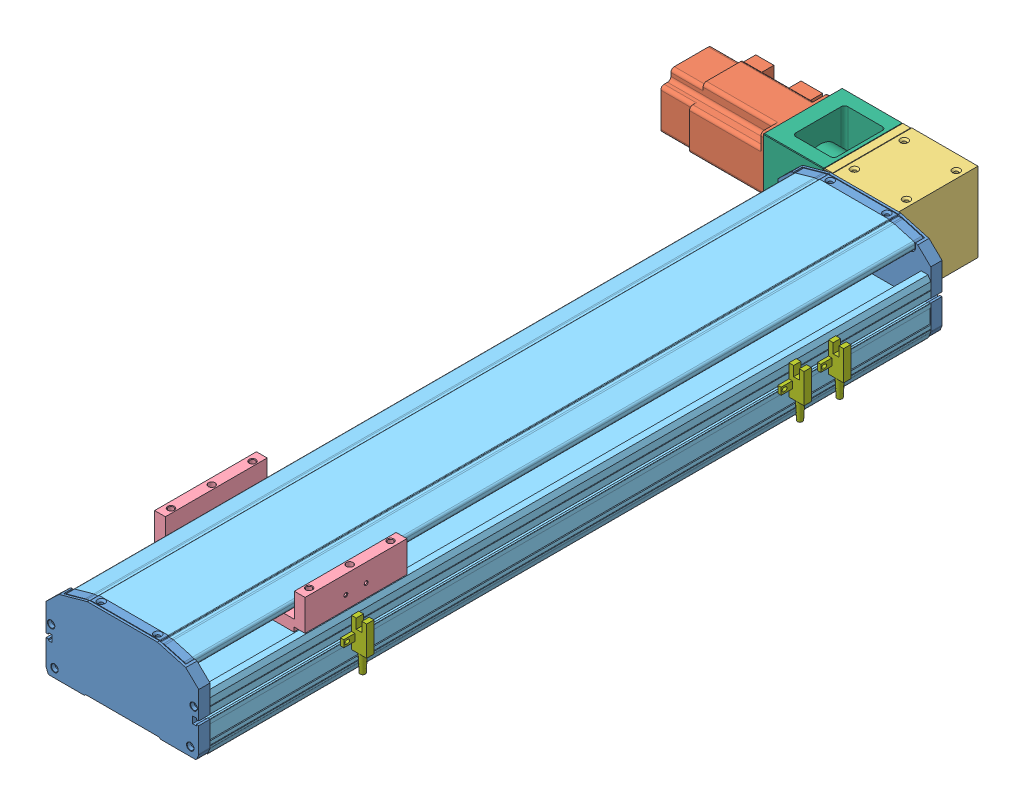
SolidWorks assembly TCD135-T-ZJ3B-0.SLDASM, configuration 400 (file format 9000). Lengths in mm.
Overall size (270.05 78 739).
10 component instances, 7 part files, 28 mates.
Components (placement in the parent):
- TCD135-T-ZJ3B-6-1: TCD135-T-ZJ3B-6.SLDPRT [默认] at origin
- TCD135-T-ZJ3B-3-1: TCD135-T-ZJ3B-3.SLDPRT [默认] at (-97.75 36.9 -35) x (0 0 1) z (-1 0 0)
- TCD135-T-ZJ3B-5-1: TCD135-T-ZJ3B-5.SLDPRT [默认] at (29.25 36.9 -35) x (0 1 0) z (-1 0 0)
- TCD135-T-ZJ3B-6-2: TCD135-T-ZJ3B-6.SLDPRT [默认] at (0 0 657) x (-1 0 0) z (0 0 -1)
- TCD135-T-ZJ3B-1-1: TCD135-T-ZJ3B-1.sldprt [默认] at (0 33.9 517)
- TCD135-T-ZJ3B-2-2: TCD135-T-ZJ3B-2.SLDPRT [400] at (0 0 10) x (-1 0 0) z (0 0 -1) size (135 73.5 637)
- TCD135-T-ZJ3B-4-1: TCD135-T-ZJ3B-4.SLDPRT [默认] at (-90.75 36.9 -35) x (0 0 -1) z (0 1 0)
- TCD135-T-ZJ3B-7-1: TCD135-T-ZJ3B-7.sldprt [默认] at (11 -5.2004 -46.2996)
- TCD135-T-ZJ3B-7-2: TCD135-T-ZJ3B-7.sldprt [默认] at (11 -5.2004 375.3004)
- TCD135-T-ZJ3B-7-3: TCD135-T-ZJ3B-7.sldprt [默认] at (11 -5.2004 -11.2996)
Mates (geometry in assembly coordinates):
- 重合6: coincident anti-aligned: plane of TCD135-T-ZJ3B-6-1 through (64.1333 0.9 0) normal (0 0 -1); plane of TCD135-T-ZJ3B-5-1 through (-29.25 1.9 0) normal (0 0 1)
- LimitDistance1: limit distance = 542 mm aligned: plane of TCD135-T-ZJ3B-5-1 through (-29.25 1.9 -70) normal (0 0 -1); plane of TCD135-T-ZJ3B-1-1 through (0 60.65 472) normal (0 0 -1)
- LimitDistance2: limit distance = 95 mm aligned: plane of TCD135-T-ZJ3B-1-1 through (0 60.65 562) normal (0 0 1); plane of TCD135-T-ZJ3B-6-2 through (-64.1333 0.9 657) normal (0 0 1)
- 重合18: coincident anti-aligned: plane of TCD135-T-ZJ3B-6-1 through (64.1333 0.9 10) normal (0 0 1); plane of TCD135-T-ZJ3B-2-2 through (67.5 6 10) normal (0 0 -1)
- 重合19: coincident aligned: plane of TCD135-T-ZJ3B-6-1 through (30.5 71.9 -105.7277) normal (0 1 0); plane of TCD135-T-ZJ3B-2-2 through (-30.5 71.9 647) normal (0 1 0)
- 重合20: coincident aligned: plane of TCD135-T-ZJ3B-6-1 through (-67.5 29.8 10) normal (-1 0 0); plane of TCD135-T-ZJ3B-2-2 through (-67.5 22.5 647) normal (-1 0 0)
- 距离7: distance = 0.5 mm aligned: plane of TCD135-T-ZJ3B-1-1 through (-66.5 62.65 517) normal (-1 0 0); plane of TCD135-T-ZJ3B-2-2 through (-67 10 647) normal (-1 0 0)
- 重合21: coincident aligned: plane of TCD135-T-ZJ3B-6-2 through (-67.5 29.8 647) normal (-1 0 0); plane of TCD135-T-ZJ3B-2-2 through (-67.5 30.1 647) normal (-1 0 0)
- 重合22: coincident aligned: plane of TCD135-T-ZJ3B-6-2 through (-30.5 71.9 762.7277) normal (0 1 0); plane of TCD135-T-ZJ3B-2-2 through (-30.5 71.9 647) normal (0 1 0)
- 重合23: coincident anti-aligned: plane of TCD135-T-ZJ3B-6-2 through (-64.1333 0.9 647) normal (0 0 -1); plane of TCD135-T-ZJ3B-2-2 through (67.5 6 647) normal (0 0 1)
- 距离8: distance = 78 mm anti-aligned: plane of TCD135-T-ZJ3B-1-1 through (-61.75 76.4 517) normal (0 1 0); plane of TCD135-T-ZJ3B-2-2 through (-34.1 -1.6 647) normal (0 -1 0)
- 重合24: coincident aligned: plane of TCD135-T-ZJ3B-5-1 through (-29.25 71.9 0) normal (0 1 0); plane of TCD135-T-ZJ3B-2-2 through (-30.5 71.9 647) normal (0 1 0)
- 距离9: distance = 30.25 mm aligned: plane of TCD135-T-ZJ3B-5-1 through (-37.25 36.9 -35) normal (-1 0 0); plane of TCD135-T-ZJ3B-6-1 through (-67.5 29.8 10) normal (-1 0 0)
- 重合28: coincident anti-aligned: plane of TCD135-T-ZJ3B-3-1 through (-90.75 9.9 -8) normal (1 0 0); plane of TCD135-T-ZJ3B-4-1 through (-90.75 36.9 -35) normal (-1 0 0)
- 距离10: distance = 5 mm aligned: plane of TCD135-T-ZJ3B-3-1 through (-189.15 6.9 -50) normal (0 -1 0); plane of TCD135-T-ZJ3B-4-1 through (-37.25 1.9 0) normal (0 -1 0)
- 距离11: distance = 5 mm aligned: plane of TCD135-T-ZJ3B-3-1 through (-189.15 51.9 -65) normal (0 0 -1); plane of TCD135-T-ZJ3B-4-1 through (-37.25 71.9 -70) normal (0 0 -1)
- 重合29: coincident anti-aligned: plane of TCD135-T-ZJ3B-5-1 through (-37.25 36.9 -35) normal (-1 0 0); plane of TCD135-T-ZJ3B-4-1 through (-37.25 36.9 -35) normal (1 0 0)
- 重合30: coincident aligned: plane of TCD135-T-ZJ3B-5-1 through (-37.25 71.9 0) normal (0 1 0); plane of TCD135-T-ZJ3B-4-1 through (-37.25 71.9 0) normal (0 1 0)
- 重合31: coincident aligned: plane of TCD135-T-ZJ3B-5-1 through (-29.25 1.9 -70) normal (0 0 -1); plane of TCD135-T-ZJ3B-4-1 through (-37.25 71.9 -70) normal (0 0 -1)
- 重合32: coincident anti-aligned: plane of TCD135-T-ZJ3B-2-2 through (67.5 35.625 647) normal (1 0 0); plane of TCD135-T-ZJ3B-7-1 through (67.5 17 110.2) normal (-1 0 0)
- 重合33: coincident aligned: plane of TCD135-T-ZJ3B-2-2 through (65.8 26.2 647) normal (0 1 0); plane of TCD135-T-ZJ3B-7-1 through (67.5 26.2 86.6) normal (0 1 0)
- 重合34: coincident anti-aligned: plane of TCD135-T-ZJ3B-2-2 through (67.5 35.625 647) normal (1 0 0); plane of TCD135-T-ZJ3B-7-2 through (67.5 17 531.8) normal (-1 0 0)
- 重合35: coincident aligned: plane of TCD135-T-ZJ3B-2-2 through (65.8 26.2 647) normal (0 1 0); plane of TCD135-T-ZJ3B-7-2 through (67.5 26.2 508.2) normal (0 1 0)
- 重合36: coincident anti-aligned: plane of TCD135-T-ZJ3B-2-2 through (67.5 35.625 647) normal (1 0 0); plane of TCD135-T-ZJ3B-7-3 through (67.5 17 145.2) normal (-1 0 0)
- 重合37: coincident aligned: plane of TCD135-T-ZJ3B-2-2 through (65.8 26.2 647) normal (0 1 0); plane of TCD135-T-ZJ3B-7-3 through (67.5 26.2 121.6) normal (0 1 0)
- 距离12: distance = 35 mm aligned: plane of TCD135-T-ZJ3B-7-3 through (67.5 17 129) normal (0 0 -1); plane of TCD135-T-ZJ3B-7-1 through (67.5 17 94) normal (0 0 -1)
- 距离13: distance = 94 mm aligned: plane of TCD135-T-ZJ3B-7-1 through (67.5 17 94) normal (0 0 -1); plane of TCD135-T-ZJ3B-6-1 through (64.1333 0.9 0) normal (0 0 -1)
- 距离14: distance = 135 mm aligned: plane of TCD135-T-ZJ3B-7-2 through (67.5 17 522) normal (0 0 1); plane of TCD135-T-ZJ3B-6-2 through (-64.1333 0.9 657) normal (0 0 1)
